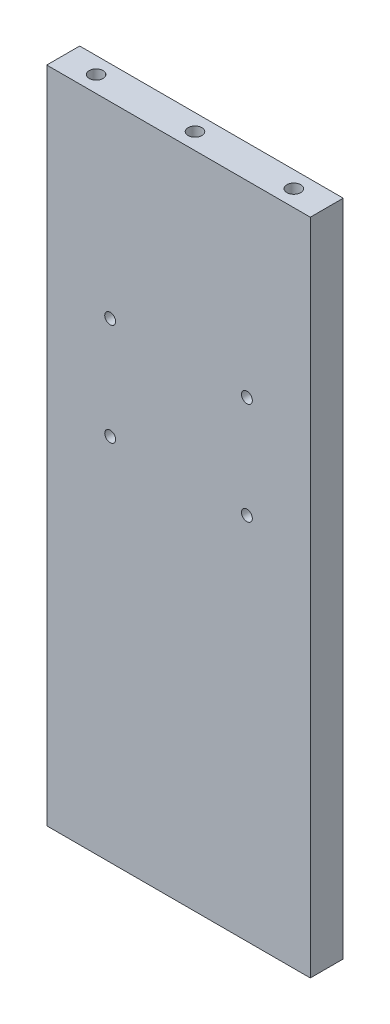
ISO-10303-21;
HEADER;
FILE_DESCRIPTION(('STEP AP214'),'2;1');
FILE_NAME('part.step','',(''),(''),'','','');
FILE_SCHEMA(('AUTOMOTIVE_DESIGN { 1 0 10303 214 1 1 1 1 }'));
ENDSEC;
DATA;
#1=APPLICATION_CONTEXT('core data for automotive mechanical design processes');
#2=APPLICATION_PROTOCOL_DEFINITION('international standard','automotive_design',2000,#1);
#3=PRODUCT_CONTEXT('',#1,'mechanical');
#4=PRODUCT('Part','Part','',(#3));
#5=PRODUCT_RELATED_PRODUCT_CATEGORY('part','',(#4));
#6=PRODUCT_DEFINITION_FORMATION('','',#4);
#7=PRODUCT_DEFINITION_CONTEXT('part definition',#1,'design');
#8=PRODUCT_DEFINITION('design','',#6,#7);
#9=PRODUCT_DEFINITION_SHAPE('','',#8);
#10=(LENGTH_UNIT() NAMED_UNIT(*) SI_UNIT(.MILLI.,.METRE.));
#11=(NAMED_UNIT(*) PLANE_ANGLE_UNIT() SI_UNIT($,.RADIAN.));
#12=(NAMED_UNIT(*) SI_UNIT($,.STERADIAN.) SOLID_ANGLE_UNIT());
#13=UNCERTAINTY_MEASURE_WITH_UNIT(LENGTH_MEASURE(1.E-05),#10,'distance_accuracy_value','');
#14=(GEOMETRIC_REPRESENTATION_CONTEXT(3) GLOBAL_UNCERTAINTY_ASSIGNED_CONTEXT((#13)) GLOBAL_UNIT_ASSIGNED_CONTEXT((#10,
#11,#12)) REPRESENTATION_CONTEXT('',''));
#15=CARTESIAN_POINT('',(0.,0.,0.));
#16=DIRECTION('',(0.,0.,1.));
#17=DIRECTION('',(1.,0.,0.));
#18=AXIS2_PLACEMENT_3D('',#15,#16,#17);
#19=CARTESIAN_POINT('',(-40.,100.,10.));
#20=DIRECTION('',(1.,0.,0.));
#21=DIRECTION('',(0.,1.,0.));
#22=AXIS2_PLACEMENT_3D('',#19,#20,#21);
#23=PLANE('',#22);
#24=DIRECTION('',(0.,-1.,0.));
#25=VECTOR('',#24,1.);
#26=CARTESIAN_POINT('',(-40.,100.,0.));
#27=LINE('',#26,#25);
#28=CARTESIAN_POINT('',(-40.,100.,0.));
#29=VERTEX_POINT('',#28);
#30=CARTESIAN_POINT('',(-40.,-100.,0.));
#31=VERTEX_POINT('',#30);
#32=EDGE_CURVE('E174',#29,#31,#27,.T.);
#33=ORIENTED_EDGE('',*,*,#32,.T.);
#34=DIRECTION('',(0.,0.,-1.));
#35=VECTOR('',#34,1.);
#36=CARTESIAN_POINT('',(-40.,-100.,10.));
#37=LINE('',#36,#35);
#38=CARTESIAN_POINT('',(-40.,-100.,10.));
#39=VERTEX_POINT('',#38);
#40=EDGE_CURVE('E11',#39,#31,#37,.T.);
#41=ORIENTED_EDGE('',*,*,#40,.F.);
#42=DIRECTION('',(0.,-1.,0.));
#43=VECTOR('',#42,1.);
#44=CARTESIAN_POINT('',(-40.,100.,10.));
#45=LINE('',#44,#43);
#46=CARTESIAN_POINT('',(-40.,100.,10.));
#47=VERTEX_POINT('',#46);
#48=EDGE_CURVE('E175',#47,#39,#45,.T.);
#49=ORIENTED_EDGE('',*,*,#48,.F.);
#50=DIRECTION('',(0.,0.,-1.));
#51=VECTOR('',#50,1.);
#52=CARTESIAN_POINT('',(-40.,100.,10.));
#53=LINE('',#52,#51);
#54=EDGE_CURVE('E181',#47,#29,#53,.T.);
#55=ORIENTED_EDGE('',*,*,#54,.T.);
#56=EDGE_LOOP('',(#33,#41,#49,#55));
#57=FACE_BOUND('',#56,.T.);
#58=ADVANCED_FACE('F39',(#57),#23,.F.);
#59=CARTESIAN_POINT('',(40.,-100.,10.));
#60=DIRECTION('',(0.,1.,0.));
#61=DIRECTION('',(0.,0.,1.));
#62=AXIS2_PLACEMENT_3D('',#59,#60,#61);
#63=PLANE('',#62);
#64=CARTESIAN_POINT('',(-30.,-100.,5.));
#65=DIRECTION('',(0.,-1.,0.));
#66=DIRECTION('',(0.,0.,-1.));
#67=AXIS2_PLACEMENT_3D('',#64,#65,#66);
#68=CIRCLE('',#67,2.09999999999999);
#69=CARTESIAN_POINT('',(-30.,-100.,2.90000000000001));
#70=VERTEX_POINT('',#69);
#71=EDGE_CURVE('E116',#70,#70,#68,.T.);
#72=ORIENTED_EDGE('',*,*,#71,.F.);
#73=EDGE_LOOP('',(#72));
#74=FACE_BOUND('',#73,.T.);
#75=CARTESIAN_POINT('',(0.,-100.,5.));
#76=DIRECTION('',(0.,-1.,0.));
#77=DIRECTION('',(0.,0.,-1.));
#78=AXIS2_PLACEMENT_3D('',#75,#76,#77);
#79=CIRCLE('',#78,2.09999999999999);
#80=CARTESIAN_POINT('',(0.,-100.,2.90000000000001));
#81=VERTEX_POINT('',#80);
#82=EDGE_CURVE('E115',#81,#81,#79,.T.);
#83=ORIENTED_EDGE('',*,*,#82,.F.);
#84=EDGE_LOOP('',(#83));
#85=FACE_BOUND('',#84,.T.);
#86=CARTESIAN_POINT('',(30.,-100.,5.));
#87=DIRECTION('',(0.,-1.,0.));
#88=DIRECTION('',(0.,0.,-1.));
#89=AXIS2_PLACEMENT_3D('',#86,#87,#88);
#90=CIRCLE('',#89,2.09999999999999);
#91=CARTESIAN_POINT('',(30.,-100.,2.90000000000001));
#92=VERTEX_POINT('',#91);
#93=EDGE_CURVE('E126',#92,#92,#90,.T.);
#94=ORIENTED_EDGE('',*,*,#93,.F.);
#95=EDGE_LOOP('',(#94));
#96=FACE_BOUND('',#95,.T.);
#97=DIRECTION('',(1.,0.,0.));
#98=VECTOR('',#97,1.);
#99=CARTESIAN_POINT('',(40.,-100.,0.));
#100=LINE('',#99,#98);
#101=CARTESIAN_POINT('',(40.,-100.,0.));
#102=VERTEX_POINT('',#101);
#103=EDGE_CURVE('E184',#31,#102,#100,.T.);
#104=ORIENTED_EDGE('',*,*,#103,.T.);
#105=DIRECTION('',(0.,0.,-1.));
#106=VECTOR('',#105,1.);
#107=CARTESIAN_POINT('',(40.,-100.,10.));
#108=LINE('',#107,#106);
#109=CARTESIAN_POINT('',(40.,-100.,10.));
#110=VERTEX_POINT('',#109);
#111=EDGE_CURVE('E47',#110,#102,#108,.T.);
#112=ORIENTED_EDGE('',*,*,#111,.F.);
#113=DIRECTION('',(1.,0.,0.));
#114=VECTOR('',#113,1.);
#115=CARTESIAN_POINT('',(40.,-100.,10.));
#116=LINE('',#115,#114);
#117=EDGE_CURVE('E86',#39,#110,#116,.T.);
#118=ORIENTED_EDGE('',*,*,#117,.F.);
#119=ORIENTED_EDGE('',*,*,#40,.T.);
#120=EDGE_LOOP('',(#104,#112,#118,#119));
#121=FACE_BOUND('',#120,.T.);
#122=ADVANCED_FACE('F209',(#74,#85,#96,#121),#63,.F.);
#123=CARTESIAN_POINT('',(40.,100.,10.));
#124=DIRECTION('',(-1.,0.,0.));
#125=DIRECTION('',(0.,-1.,0.));
#126=AXIS2_PLACEMENT_3D('',#123,#124,#125);
#127=PLANE('',#126);
#128=DIRECTION('',(0.,1.,0.));
#129=VECTOR('',#128,1.);
#130=CARTESIAN_POINT('',(40.,100.,0.));
#131=LINE('',#130,#129);
#132=CARTESIAN_POINT('',(40.,100.,0.));
#133=VERTEX_POINT('',#132);
#134=EDGE_CURVE('E73',#102,#133,#131,.T.);
#135=ORIENTED_EDGE('',*,*,#134,.T.);
#136=DIRECTION('',(0.,0.,-1.));
#137=VECTOR('',#136,1.);
#138=CARTESIAN_POINT('',(40.,100.,10.));
#139=LINE('',#138,#137);
#140=CARTESIAN_POINT('',(40.,100.,10.));
#141=VERTEX_POINT('',#140);
#142=EDGE_CURVE('E189',#141,#133,#139,.T.);
#143=ORIENTED_EDGE('',*,*,#142,.F.);
#144=DIRECTION('',(0.,1.,0.));
#145=VECTOR('',#144,1.);
#146=CARTESIAN_POINT('',(40.,100.,10.));
#147=LINE('',#146,#145);
#148=EDGE_CURVE('E178',#110,#141,#147,.T.);
#149=ORIENTED_EDGE('',*,*,#148,.F.);
#150=ORIENTED_EDGE('',*,*,#111,.T.);
#151=EDGE_LOOP('',(#135,#143,#149,#150));
#152=FACE_BOUND('',#151,.T.);
#153=ADVANCED_FACE('F191',(#152),#127,.F.);
#154=CARTESIAN_POINT('',(40.,100.,10.));
#155=DIRECTION('',(0.,-1.,0.));
#156=DIRECTION('',(0.,0.,-1.));
#157=AXIS2_PLACEMENT_3D('',#154,#155,#156);
#158=PLANE('',#157);
#159=CARTESIAN_POINT('',(-30.,100.,5.));
#160=DIRECTION('',(0.,1.,0.));
#161=DIRECTION('',(0.,0.,1.));
#162=AXIS2_PLACEMENT_3D('',#159,#160,#161);
#163=CIRCLE('',#162,2.09999999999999);
#164=CARTESIAN_POINT('',(-30.,100.,7.09999999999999));
#165=VERTEX_POINT('',#164);
#166=EDGE_CURVE('E132',#165,#165,#163,.T.);
#167=ORIENTED_EDGE('',*,*,#166,.F.);
#168=EDGE_LOOP('',(#167));
#169=FACE_BOUND('',#168,.T.);
#170=CARTESIAN_POINT('',(0.,100.,5.));
#171=DIRECTION('',(0.,1.,0.));
#172=DIRECTION('',(0.,0.,1.));
#173=AXIS2_PLACEMENT_3D('',#170,#171,#172);
#174=CIRCLE('',#173,2.09999999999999);
#175=CARTESIAN_POINT('',(0.,100.,7.09999999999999));
#176=VERTEX_POINT('',#175);
#177=EDGE_CURVE('E138',#176,#176,#174,.T.);
#178=ORIENTED_EDGE('',*,*,#177,.F.);
#179=EDGE_LOOP('',(#178));
#180=FACE_BOUND('',#179,.T.);
#181=CARTESIAN_POINT('',(30.,100.,5.));
#182=DIRECTION('',(0.,1.,0.));
#183=DIRECTION('',(0.,0.,1.));
#184=AXIS2_PLACEMENT_3D('',#181,#182,#183);
#185=CIRCLE('',#184,2.09999999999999);
#186=CARTESIAN_POINT('',(30.,100.,7.09999999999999));
#187=VERTEX_POINT('',#186);
#188=EDGE_CURVE('E144',#187,#187,#185,.T.);
#189=ORIENTED_EDGE('',*,*,#188,.F.);
#190=EDGE_LOOP('',(#189));
#191=FACE_BOUND('',#190,.T.);
#192=DIRECTION('',(-1.,0.,0.));
#193=VECTOR('',#192,1.);
#194=CARTESIAN_POINT('',(40.,100.,0.));
#195=LINE('',#194,#193);
#196=EDGE_CURVE('E79',#133,#29,#195,.T.);
#197=ORIENTED_EDGE('',*,*,#196,.T.);
#198=ORIENTED_EDGE('',*,*,#54,.F.);
#199=DIRECTION('',(-1.,0.,0.));
#200=VECTOR('',#199,1.);
#201=CARTESIAN_POINT('',(40.,100.,10.));
#202=LINE('',#201,#200);
#203=EDGE_CURVE('E55',#141,#47,#202,.T.);
#204=ORIENTED_EDGE('',*,*,#203,.F.);
#205=ORIENTED_EDGE('',*,*,#142,.T.);
#206=EDGE_LOOP('',(#197,#198,#204,#205));
#207=FACE_BOUND('',#206,.T.);
#208=ADVANCED_FACE('F198',(#169,#180,#191,#207),#158,.F.);
#209=CARTESIAN_POINT('',(0.,0.,10.));
#210=DIRECTION('',(0.,0.,-1.));
#211=DIRECTION('',(-1.,0.,0.));
#212=AXIS2_PLACEMENT_3D('',#209,#210,#211);
#213=PLANE('',#212);
#214=CARTESIAN_POINT('',(-20.75,43.,10.));
#215=DIRECTION('',(0.,0.,1.));
#216=DIRECTION('',(1.,0.,0.));
#217=AXIS2_PLACEMENT_3D('',#214,#215,#216);
#218=CIRCLE('',#217,1.65);
#219=CARTESIAN_POINT('',(-19.1,43.,10.));
#220=VERTEX_POINT('',#219);
#221=EDGE_CURVE('E150',#220,#220,#218,.T.);
#222=ORIENTED_EDGE('',*,*,#221,.F.);
#223=EDGE_LOOP('',(#222));
#224=FACE_BOUND('',#223,.T.);
#225=CARTESIAN_POINT('',(20.75,43.,10.));
#226=DIRECTION('',(0.,0.,1.));
#227=DIRECTION('',(1.,0.,0.));
#228=AXIS2_PLACEMENT_3D('',#225,#226,#227);
#229=CIRCLE('',#228,1.65);
#230=CARTESIAN_POINT('',(22.4,43.,10.));
#231=VERTEX_POINT('',#230);
#232=EDGE_CURVE('E156',#231,#231,#229,.T.);
#233=ORIENTED_EDGE('',*,*,#232,.F.);
#234=EDGE_LOOP('',(#233));
#235=FACE_BOUND('',#234,.T.);
#236=CARTESIAN_POINT('',(20.75,12.,10.));
#237=DIRECTION('',(0.,0.,1.));
#238=DIRECTION('',(1.,0.,0.));
#239=AXIS2_PLACEMENT_3D('',#236,#237,#238);
#240=CIRCLE('',#239,1.65);
#241=CARTESIAN_POINT('',(22.4,12.,10.));
#242=VERTEX_POINT('',#241);
#243=EDGE_CURVE('E162',#242,#242,#240,.T.);
#244=ORIENTED_EDGE('',*,*,#243,.F.);
#245=EDGE_LOOP('',(#244));
#246=FACE_BOUND('',#245,.T.);
#247=CARTESIAN_POINT('',(-20.75,12.,10.));
#248=DIRECTION('',(0.,0.,1.));
#249=DIRECTION('',(1.,0.,0.));
#250=AXIS2_PLACEMENT_3D('',#247,#248,#249);
#251=CIRCLE('',#250,1.65);
#252=CARTESIAN_POINT('',(-19.1,12.,10.));
#253=VERTEX_POINT('',#252);
#254=EDGE_CURVE('E168',#253,#253,#251,.T.);
#255=ORIENTED_EDGE('',*,*,#254,.F.);
#256=EDGE_LOOP('',(#255));
#257=FACE_BOUND('',#256,.T.);
#258=ORIENTED_EDGE('',*,*,#48,.T.);
#259=ORIENTED_EDGE('',*,*,#117,.T.);
#260=ORIENTED_EDGE('',*,*,#148,.T.);
#261=ORIENTED_EDGE('',*,*,#203,.T.);
#262=EDGE_LOOP('',(#258,#259,#260,#261));
#263=FACE_BOUND('',#262,.T.);
#264=ADVANCED_FACE('F200',(#224,#235,#246,#257,#263),#213,.F.);
#265=CARTESIAN_POINT('',(0.,0.,0.));
#266=DIRECTION('',(0.,0.,-1.));
#267=DIRECTION('',(-1.,0.,0.));
#268=AXIS2_PLACEMENT_3D('',#265,#266,#267);
#269=PLANE('',#268);
#270=CARTESIAN_POINT('',(-20.75,43.,0.));
#271=DIRECTION('',(0.,0.,1.));
#272=DIRECTION('',(1.,0.,0.));
#273=AXIS2_PLACEMENT_3D('',#270,#271,#272);
#274=CIRCLE('',#273,1.65);
#275=CARTESIAN_POINT('',(-19.1,43.,0.));
#276=VERTEX_POINT('',#275);
#277=EDGE_CURVE('E153',#276,#276,#274,.T.);
#278=ORIENTED_EDGE('',*,*,#277,.T.);
#279=EDGE_LOOP('',(#278));
#280=FACE_BOUND('',#279,.T.);
#281=CARTESIAN_POINT('',(20.75,43.,0.));
#282=DIRECTION('',(0.,0.,1.));
#283=DIRECTION('',(1.,0.,0.));
#284=AXIS2_PLACEMENT_3D('',#281,#282,#283);
#285=CIRCLE('',#284,1.65);
#286=CARTESIAN_POINT('',(22.4,43.,0.));
#287=VERTEX_POINT('',#286);
#288=EDGE_CURVE('E159',#287,#287,#285,.T.);
#289=ORIENTED_EDGE('',*,*,#288,.T.);
#290=EDGE_LOOP('',(#289));
#291=FACE_BOUND('',#290,.T.);
#292=CARTESIAN_POINT('',(20.75,12.,0.));
#293=DIRECTION('',(0.,0.,1.));
#294=DIRECTION('',(1.,0.,0.));
#295=AXIS2_PLACEMENT_3D('',#292,#293,#294);
#296=CIRCLE('',#295,1.65);
#297=CARTESIAN_POINT('',(22.4,12.,0.));
#298=VERTEX_POINT('',#297);
#299=EDGE_CURVE('E165',#298,#298,#296,.T.);
#300=ORIENTED_EDGE('',*,*,#299,.T.);
#301=EDGE_LOOP('',(#300));
#302=FACE_BOUND('',#301,.T.);
#303=CARTESIAN_POINT('',(-20.75,12.,0.));
#304=DIRECTION('',(0.,0.,1.));
#305=DIRECTION('',(1.,0.,0.));
#306=AXIS2_PLACEMENT_3D('',#303,#304,#305);
#307=CIRCLE('',#306,1.65);
#308=CARTESIAN_POINT('',(-19.1,12.,0.));
#309=VERTEX_POINT('',#308);
#310=EDGE_CURVE('E171',#309,#309,#307,.T.);
#311=ORIENTED_EDGE('',*,*,#310,.T.);
#312=EDGE_LOOP('',(#311));
#313=FACE_BOUND('',#312,.T.);
#314=ORIENTED_EDGE('',*,*,#32,.F.);
#315=ORIENTED_EDGE('',*,*,#196,.F.);
#316=ORIENTED_EDGE('',*,*,#134,.F.);
#317=ORIENTED_EDGE('',*,*,#103,.F.);
#318=EDGE_LOOP('',(#314,#315,#316,#317));
#319=FACE_BOUND('',#318,.T.);
#320=ADVANCED_FACE('F194',(#280,#291,#302,#313,#319),#269,.T.);
#321=CARTESIAN_POINT('',(-20.75,12.,10.));
#322=DIRECTION('',(0.,0.,1.));
#323=DIRECTION('',(1.,0.,0.));
#324=AXIS2_PLACEMENT_3D('',#321,#322,#323);
#325=CYLINDRICAL_SURFACE('',#324,1.65);
#326=ORIENTED_EDGE('',*,*,#310,.F.);
#327=EDGE_LOOP('',(#326));
#328=FACE_BOUND('',#327,.T.);
#329=ORIENTED_EDGE('',*,*,#254,.T.);
#330=EDGE_LOOP('',(#329));
#331=FACE_BOUND('',#330,.T.);
#332=ADVANCED_FACE('F279',(#328,#331),#325,.F.);
#333=CARTESIAN_POINT('',(20.75,12.,10.));
#334=DIRECTION('',(0.,0.,1.));
#335=DIRECTION('',(1.,0.,0.));
#336=AXIS2_PLACEMENT_3D('',#333,#334,#335);
#337=CYLINDRICAL_SURFACE('',#336,1.65);
#338=ORIENTED_EDGE('',*,*,#299,.F.);
#339=EDGE_LOOP('',(#338));
#340=FACE_BOUND('',#339,.T.);
#341=ORIENTED_EDGE('',*,*,#243,.T.);
#342=EDGE_LOOP('',(#341));
#343=FACE_BOUND('',#342,.T.);
#344=ADVANCED_FACE('F275',(#340,#343),#337,.F.);
#345=CARTESIAN_POINT('',(20.75,43.,10.));
#346=DIRECTION('',(0.,0.,1.));
#347=DIRECTION('',(1.,0.,0.));
#348=AXIS2_PLACEMENT_3D('',#345,#346,#347);
#349=CYLINDRICAL_SURFACE('',#348,1.65);
#350=ORIENTED_EDGE('',*,*,#288,.F.);
#351=EDGE_LOOP('',(#350));
#352=FACE_BOUND('',#351,.T.);
#353=ORIENTED_EDGE('',*,*,#232,.T.);
#354=EDGE_LOOP('',(#353));
#355=FACE_BOUND('',#354,.T.);
#356=ADVANCED_FACE('F271',(#352,#355),#349,.F.);
#357=CARTESIAN_POINT('',(-20.75,43.,10.));
#358=DIRECTION('',(0.,0.,1.));
#359=DIRECTION('',(1.,0.,0.));
#360=AXIS2_PLACEMENT_3D('',#357,#358,#359);
#361=CYLINDRICAL_SURFACE('',#360,1.65);
#362=ORIENTED_EDGE('',*,*,#277,.F.);
#363=EDGE_LOOP('',(#362));
#364=FACE_BOUND('',#363,.T.);
#365=ORIENTED_EDGE('',*,*,#221,.T.);
#366=EDGE_LOOP('',(#365));
#367=FACE_BOUND('',#366,.T.);
#368=ADVANCED_FACE('F267',(#364,#367),#361,.F.);
#369=CARTESIAN_POINT('',(30.,88.,5.));
#370=DIRECTION('',(0.,1.,0.));
#371=DIRECTION('',(0.,0.,1.));
#372=AXIS2_PLACEMENT_3D('',#369,#370,#371);
#373=CONICAL_SURFACE('',#372,2.1,1.02974425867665);
#374=CARTESIAN_POINT('',(30.,86.7381927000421,5.));
#375=VERTEX_POINT('',#374);
#376=VERTEX_LOOP('',#375);
#377=FACE_BOUND('',#376,.T.);
#378=CARTESIAN_POINT('',(30.,88.,5.));
#379=DIRECTION('',(0.,1.,0.));
#380=DIRECTION('',(0.,0.,1.));
#381=AXIS2_PLACEMENT_3D('',#378,#379,#380);
#382=CIRCLE('',#381,2.1);
#383=CARTESIAN_POINT('',(30.,88.,7.1));
#384=VERTEX_POINT('',#383);
#385=EDGE_CURVE('E147',#384,#384,#382,.T.);
#386=ORIENTED_EDGE('',*,*,#385,.T.);
#387=EDGE_LOOP('',(#386));
#388=FACE_BOUND('',#387,.T.);
#389=ADVANCED_FACE('F263',(#377,#388),#373,.F.);
#390=CARTESIAN_POINT('',(30.,100.,5.));
#391=DIRECTION('',(0.,1.,0.));
#392=DIRECTION('',(0.,0.,1.));
#393=AXIS2_PLACEMENT_3D('',#390,#391,#392);
#394=CYLINDRICAL_SURFACE('',#393,2.09999999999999);
#395=ORIENTED_EDGE('',*,*,#385,.F.);
#396=EDGE_LOOP('',(#395));
#397=FACE_BOUND('',#396,.T.);
#398=ORIENTED_EDGE('',*,*,#188,.T.);
#399=EDGE_LOOP('',(#398));
#400=FACE_BOUND('',#399,.T.);
#401=ADVANCED_FACE('F259',(#397,#400),#394,.F.);
#402=CARTESIAN_POINT('',(0.,88.,5.));
#403=DIRECTION('',(0.,1.,0.));
#404=DIRECTION('',(0.,0.,1.));
#405=AXIS2_PLACEMENT_3D('',#402,#403,#404);
#406=CONICAL_SURFACE('',#405,2.1,1.02974425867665);
#407=CARTESIAN_POINT('',(0.,86.7381927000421,5.));
#408=VERTEX_POINT('',#407);
#409=VERTEX_LOOP('',#408);
#410=FACE_BOUND('',#409,.T.);
#411=CARTESIAN_POINT('',(0.,88.,5.));
#412=DIRECTION('',(0.,1.,0.));
#413=DIRECTION('',(0.,0.,1.));
#414=AXIS2_PLACEMENT_3D('',#411,#412,#413);
#415=CIRCLE('',#414,2.1);
#416=CARTESIAN_POINT('',(0.,88.,7.1));
#417=VERTEX_POINT('',#416);
#418=EDGE_CURVE('E141',#417,#417,#415,.T.);
#419=ORIENTED_EDGE('',*,*,#418,.T.);
#420=EDGE_LOOP('',(#419));
#421=FACE_BOUND('',#420,.T.);
#422=ADVANCED_FACE('F255',(#410,#421),#406,.F.);
#423=CARTESIAN_POINT('',(0.,100.,5.));
#424=DIRECTION('',(0.,1.,0.));
#425=DIRECTION('',(0.,0.,1.));
#426=AXIS2_PLACEMENT_3D('',#423,#424,#425);
#427=CYLINDRICAL_SURFACE('',#426,2.09999999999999);
#428=ORIENTED_EDGE('',*,*,#418,.F.);
#429=EDGE_LOOP('',(#428));
#430=FACE_BOUND('',#429,.T.);
#431=ORIENTED_EDGE('',*,*,#177,.T.);
#432=EDGE_LOOP('',(#431));
#433=FACE_BOUND('',#432,.T.);
#434=ADVANCED_FACE('F251',(#430,#433),#427,.F.);
#435=CARTESIAN_POINT('',(-30.,88.,5.));
#436=DIRECTION('',(0.,1.,0.));
#437=DIRECTION('',(0.,0.,1.));
#438=AXIS2_PLACEMENT_3D('',#435,#436,#437);
#439=CONICAL_SURFACE('',#438,2.1,1.02974425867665);
#440=CARTESIAN_POINT('',(-30.,86.7381927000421,5.));
#441=VERTEX_POINT('',#440);
#442=VERTEX_LOOP('',#441);
#443=FACE_BOUND('',#442,.T.);
#444=CARTESIAN_POINT('',(-30.,88.,5.));
#445=DIRECTION('',(0.,1.,0.));
#446=DIRECTION('',(0.,0.,1.));
#447=AXIS2_PLACEMENT_3D('',#444,#445,#446);
#448=CIRCLE('',#447,2.1);
#449=CARTESIAN_POINT('',(-30.,88.,7.1));
#450=VERTEX_POINT('',#449);
#451=EDGE_CURVE('E135',#450,#450,#448,.T.);
#452=ORIENTED_EDGE('',*,*,#451,.T.);
#453=EDGE_LOOP('',(#452));
#454=FACE_BOUND('',#453,.T.);
#455=ADVANCED_FACE('F247',(#443,#454),#439,.F.);
#456=CARTESIAN_POINT('',(-30.,100.,5.));
#457=DIRECTION('',(0.,1.,0.));
#458=DIRECTION('',(0.,0.,1.));
#459=AXIS2_PLACEMENT_3D('',#456,#457,#458);
#460=CYLINDRICAL_SURFACE('',#459,2.09999999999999);
#461=ORIENTED_EDGE('',*,*,#451,.F.);
#462=EDGE_LOOP('',(#461));
#463=FACE_BOUND('',#462,.T.);
#464=ORIENTED_EDGE('',*,*,#166,.T.);
#465=EDGE_LOOP('',(#464));
#466=FACE_BOUND('',#465,.T.);
#467=ADVANCED_FACE('F239',(#463,#466),#460,.F.);
#468=CARTESIAN_POINT('',(30.,-88.,5.));
#469=DIRECTION('',(0.,-1.,0.));
#470=DIRECTION('',(0.,0.,-1.));
#471=AXIS2_PLACEMENT_3D('',#468,#469,#470);
#472=CONICAL_SURFACE('',#471,2.1,1.02974425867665);
#473=CARTESIAN_POINT('',(30.,-86.7381927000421,5.));
#474=VERTEX_POINT('',#473);
#475=VERTEX_LOOP('',#474);
#476=FACE_BOUND('',#475,.T.);
#477=CARTESIAN_POINT('',(30.,-88.,5.));
#478=DIRECTION('',(0.,-1.,0.));
#479=DIRECTION('',(0.,0.,-1.));
#480=AXIS2_PLACEMENT_3D('',#477,#478,#479);
#481=CIRCLE('',#480,2.1);
#482=CARTESIAN_POINT('',(30.,-88.,2.9));
#483=VERTEX_POINT('',#482);
#484=EDGE_CURVE('E129',#483,#483,#481,.T.);
#485=ORIENTED_EDGE('',*,*,#484,.T.);
#486=EDGE_LOOP('',(#485));
#487=FACE_BOUND('',#486,.T.);
#488=ADVANCED_FACE('F230',(#476,#487),#472,.F.);
#489=CARTESIAN_POINT('',(30.,-100.,5.));
#490=DIRECTION('',(0.,-1.,0.));
#491=DIRECTION('',(0.,0.,-1.));
#492=AXIS2_PLACEMENT_3D('',#489,#490,#491);
#493=CYLINDRICAL_SURFACE('',#492,2.09999999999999);
#494=ORIENTED_EDGE('',*,*,#484,.F.);
#495=EDGE_LOOP('',(#494));
#496=FACE_BOUND('',#495,.T.);
#497=ORIENTED_EDGE('',*,*,#93,.T.);
#498=EDGE_LOOP('',(#497));
#499=FACE_BOUND('',#498,.T.);
#500=ADVANCED_FACE('F227',(#496,#499),#493,.F.);
#501=CARTESIAN_POINT('',(0.,-88.,5.));
#502=DIRECTION('',(0.,-1.,0.));
#503=DIRECTION('',(0.,0.,-1.));
#504=AXIS2_PLACEMENT_3D('',#501,#502,#503);
#505=CONICAL_SURFACE('',#504,2.1,1.02974425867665);
#506=CARTESIAN_POINT('',(0.,-86.7381927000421,5.));
#507=VERTEX_POINT('',#506);
#508=VERTEX_LOOP('',#507);
#509=FACE_BOUND('',#508,.T.);
#510=CARTESIAN_POINT('',(0.,-88.,5.));
#511=DIRECTION('',(0.,-1.,0.));
#512=DIRECTION('',(0.,0.,-1.));
#513=AXIS2_PLACEMENT_3D('',#510,#511,#512);
#514=CIRCLE('',#513,2.1);
#515=CARTESIAN_POINT('',(0.,-88.,2.9));
#516=VERTEX_POINT('',#515);
#517=EDGE_CURVE('E119',#516,#516,#514,.T.);
#518=ORIENTED_EDGE('',*,*,#517,.T.);
#519=EDGE_LOOP('',(#518));
#520=FACE_BOUND('',#519,.T.);
#521=ADVANCED_FACE('F229',(#509,#520),#505,.F.);
#522=CARTESIAN_POINT('',(0.,-100.,5.));
#523=DIRECTION('',(0.,-1.,0.));
#524=DIRECTION('',(0.,0.,-1.));
#525=AXIS2_PLACEMENT_3D('',#522,#523,#524);
#526=CYLINDRICAL_SURFACE('',#525,2.09999999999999);
#527=ORIENTED_EDGE('',*,*,#517,.F.);
#528=EDGE_LOOP('',(#527));
#529=FACE_BOUND('',#528,.T.);
#530=ORIENTED_EDGE('',*,*,#82,.T.);
#531=EDGE_LOOP('',(#530));
#532=FACE_BOUND('',#531,.T.);
#533=ADVANCED_FACE('F109',(#529,#532),#526,.F.);
#534=CARTESIAN_POINT('',(-30.,-88.,5.));
#535=DIRECTION('',(0.,-1.,0.));
#536=DIRECTION('',(0.,0.,-1.));
#537=AXIS2_PLACEMENT_3D('',#534,#535,#536);
#538=CONICAL_SURFACE('',#537,2.1,1.02974425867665);
#539=CARTESIAN_POINT('',(-30.,-86.7381927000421,5.));
#540=VERTEX_POINT('',#539);
#541=VERTEX_LOOP('',#540);
#542=FACE_BOUND('',#541,.T.);
#543=CARTESIAN_POINT('',(-30.,-88.,5.));
#544=DIRECTION('',(0.,-1.,0.));
#545=DIRECTION('',(0.,0.,-1.));
#546=AXIS2_PLACEMENT_3D('',#543,#544,#545);
#547=CIRCLE('',#546,2.1);
#548=CARTESIAN_POINT('',(-30.,-88.,2.9));
#549=VERTEX_POINT('',#548);
#550=EDGE_CURVE('E113',#549,#549,#547,.T.);
#551=ORIENTED_EDGE('',*,*,#550,.T.);
#552=EDGE_LOOP('',(#551));
#553=FACE_BOUND('',#552,.T.);
#554=ADVANCED_FACE('F105',(#542,#553),#538,.F.);
#555=CARTESIAN_POINT('',(-30.,-100.,5.));
#556=DIRECTION('',(0.,-1.,0.));
#557=DIRECTION('',(0.,0.,-1.));
#558=AXIS2_PLACEMENT_3D('',#555,#556,#557);
#559=CYLINDRICAL_SURFACE('',#558,2.09999999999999);
#560=ORIENTED_EDGE('',*,*,#550,.F.);
#561=EDGE_LOOP('',(#560));
#562=FACE_BOUND('',#561,.T.);
#563=ORIENTED_EDGE('',*,*,#71,.T.);
#564=EDGE_LOOP('',(#563));
#565=FACE_BOUND('',#564,.T.);
#566=ADVANCED_FACE('F108',(#562,#565),#559,.F.);
#567=CLOSED_SHELL('',(#58,#122,#153,#208,#264,#320,#332,#344,#356,#368,#389,#401,#422,#434,#455,
#467,#488,#500,#521,#533,#554,#566));
#568=MANIFOLD_SOLID_BREP('B2',#567);
#569=ADVANCED_BREP_SHAPE_REPRESENTATION('',(#18,#568),#14);
#570=SHAPE_DEFINITION_REPRESENTATION(#9,#569);
ENDSEC;
END-ISO-10303-21;
